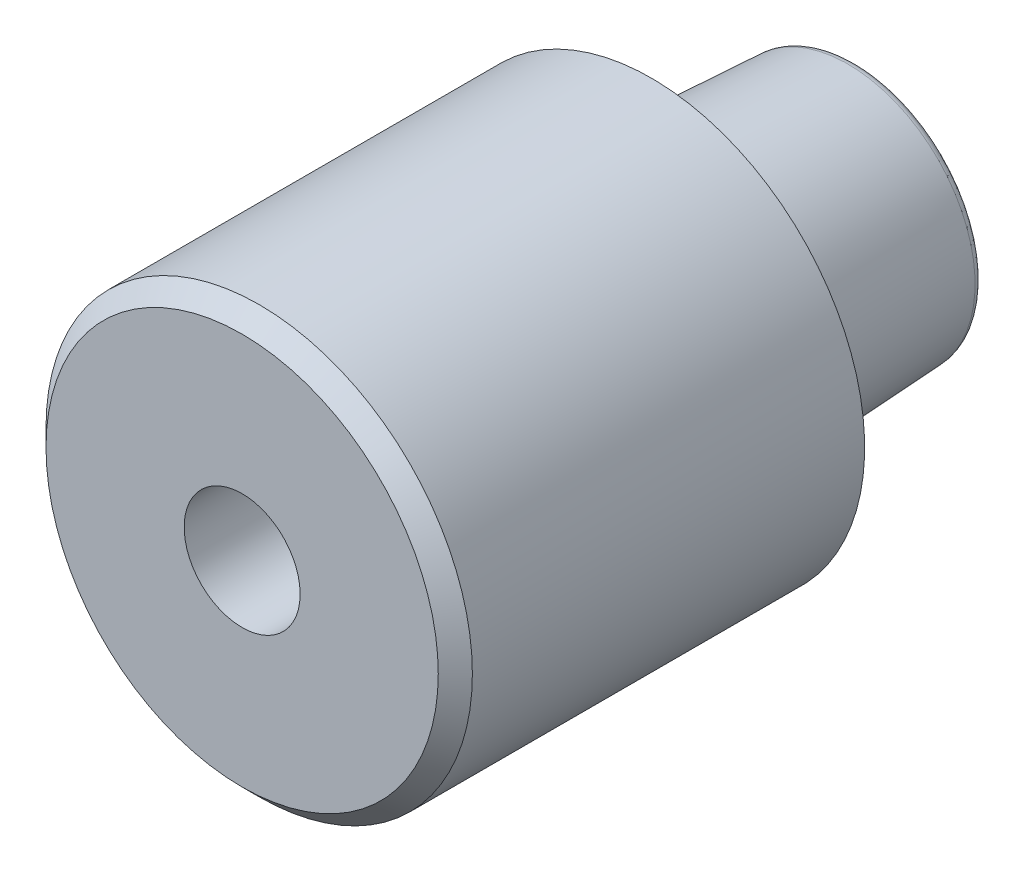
ISO-10303-21;
HEADER;
FILE_DESCRIPTION(('STEP AP214'),'2;1');
FILE_NAME('part.step','',(''),(''),'','','');
FILE_SCHEMA(('AUTOMOTIVE_DESIGN { 1 0 10303 214 1 1 1 1 }'));
ENDSEC;
DATA;
#1=APPLICATION_CONTEXT('core data for automotive mechanical design processes');
#2=APPLICATION_PROTOCOL_DEFINITION('international standard','automotive_design',2000,#1);
#3=PRODUCT_CONTEXT('',#1,'mechanical');
#4=PRODUCT('Part','Part','',(#3));
#5=PRODUCT_RELATED_PRODUCT_CATEGORY('part','',(#4));
#6=PRODUCT_DEFINITION_FORMATION('','',#4);
#7=PRODUCT_DEFINITION_CONTEXT('part definition',#1,'design');
#8=PRODUCT_DEFINITION('design','',#6,#7);
#9=PRODUCT_DEFINITION_SHAPE('','',#8);
#10=(LENGTH_UNIT() NAMED_UNIT(*) SI_UNIT(.MILLI.,.METRE.));
#11=(NAMED_UNIT(*) PLANE_ANGLE_UNIT() SI_UNIT($,.RADIAN.));
#12=(NAMED_UNIT(*) SI_UNIT($,.STERADIAN.) SOLID_ANGLE_UNIT());
#13=UNCERTAINTY_MEASURE_WITH_UNIT(LENGTH_MEASURE(1.E-05),#10,'distance_accuracy_value','');
#14=(GEOMETRIC_REPRESENTATION_CONTEXT(3) GLOBAL_UNCERTAINTY_ASSIGNED_CONTEXT((#13)) GLOBAL_UNIT_ASSIGNED_CONTEXT((#10,
#11,#12)) REPRESENTATION_CONTEXT('',''));
#15=CARTESIAN_POINT('',(0.,0.,0.));
#16=DIRECTION('',(0.,0.,1.));
#17=DIRECTION('',(1.,0.,0.));
#18=AXIS2_PLACEMENT_3D('',#15,#16,#17);
#19=CARTESIAN_POINT('',(1.31435631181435E-13,0.,18.8223304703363));
#20=DIRECTION('',(0.,0.,-1.));
#21=DIRECTION('',(1.,0.,0.));
#22=AXIS2_PLACEMENT_3D('',#19,#20,#21);
#23=CONICAL_SURFACE('',#22,17.6776695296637,0.785398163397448);
#24=CARTESIAN_POINT('',(1.74574066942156E-13,0.,25.));
#25=DIRECTION('',(0.,0.,-1.));
#26=DIRECTION('',(-1.,0.,0.));
#27=AXIS2_PLACEMENT_3D('',#24,#25,#26);
#28=CIRCLE('',#27,11.5);
#29=CARTESIAN_POINT('',(-11.4999999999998,0.,25.));
#30=VERTEX_POINT('',#29);
#31=CARTESIAN_POINT('',(11.5000000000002,0.,25.));
#32=VERTEX_POINT('',#31);
#33=EDGE_CURVE('E59',#30,#32,#28,.T.);
#34=ORIENTED_EDGE('',*,*,#33,.T.);
#35=CARTESIAN_POINT('',(11.4999968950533,0.,25.0000031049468));
#36=CARTESIAN_POINT('',(12.4999974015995,0.,24.0000025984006));
#37=B_SPLINE_CURVE_WITH_KNOTS('',1,(#35,#36),.UNSPECIFIED.,.F.,.F.,(2,2),(0.650538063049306,
0.707106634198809),.UNSPECIFIED.);
#38=CARTESIAN_POINT('',(12.5000000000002,0.,24.));
#39=VERTEX_POINT('',#38);
#40=EDGE_CURVE('E46',#32,#39,#37,.T.);
#41=ORIENTED_EDGE('',*,*,#40,.T.);
#42=CARTESIAN_POINT('',(1.6759110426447E-13,0.,24.));
#43=DIRECTION('',(0.,0.,1.));
#44=DIRECTION('',(-1.,0.,0.));
#45=AXIS2_PLACEMENT_3D('',#42,#43,#44);
#46=CIRCLE('',#45,12.5);
#47=CARTESIAN_POINT('',(-12.4999999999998,0.,24.));
#48=VERTEX_POINT('',#47);
#49=EDGE_CURVE('E97',#39,#48,#46,.T.);
#50=ORIENTED_EDGE('',*,*,#49,.T.);
#51=CARTESIAN_POINT('',(1.6759110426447E-13,0.,24.));
#52=DIRECTION('',(0.,0.,1.));
#53=DIRECTION('',(-1.,0.,0.));
#54=AXIS2_PLACEMENT_3D('',#51,#52,#53);
#55=CIRCLE('',#54,12.5);
#56=EDGE_CURVE('E11',#48,#39,#55,.T.);
#57=ORIENTED_EDGE('',*,*,#56,.T.);
#58=ORIENTED_EDGE('',*,*,#40,.F.);
#59=CARTESIAN_POINT('',(1.74574066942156E-13,0.,25.));
#60=DIRECTION('',(0.,0.,-1.));
#61=DIRECTION('',(-1.,0.,0.));
#62=AXIS2_PLACEMENT_3D('',#59,#60,#61);
#63=CIRCLE('',#62,11.5);
#64=EDGE_CURVE('E94',#32,#30,#63,.T.);
#65=ORIENTED_EDGE('',*,*,#64,.T.);
#66=EDGE_LOOP('',(#34,#41,#50,#57,#58,#65));
#67=FACE_BOUND('',#66,.T.);
#68=ADVANCED_FACE('F38',(#67),#23,.T.);
#69=CARTESIAN_POINT('',(0.,0.,13.));
#70=DIRECTION('',(0.,0.,-1.));
#71=DIRECTION('',(-1.,0.,0.));
#72=AXIS2_PLACEMENT_3D('',#69,#70,#71);
#73=CYLINDRICAL_SURFACE('',#72,12.5);
#74=ORIENTED_EDGE('',*,*,#49,.F.);
#75=ORIENTED_EDGE('',*,*,#56,.F.);
#76=CARTESIAN_POINT('',(-12.4999999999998,0.,24.0000008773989));
#77=CARTESIAN_POINT('',(-12.5,0.,0.999997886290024));
#78=B_SPLINE_CURVE_WITH_KNOTS('',1,(#76,#77),.UNSPECIFIED.,.F.,.F.,(2,2),(0.0833333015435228,
0.916666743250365),.UNSPECIFIED.);
#79=CARTESIAN_POINT('',(-12.5,0.,1.00000000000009));
#80=VERTEX_POINT('',#79);
#81=EDGE_CURVE('E132',#48,#80,#78,.T.);
#82=ORIENTED_EDGE('',*,*,#81,.T.);
#83=CARTESIAN_POINT('',(0.,0.,1.));
#84=DIRECTION('',(0.,0.,-1.));
#85=DIRECTION('',(-1.,0.,0.));
#86=AXIS2_PLACEMENT_3D('',#83,#84,#85);
#87=CIRCLE('',#86,12.5);
#88=EDGE_CURVE('E137',#80,#80,#87,.T.);
#89=ORIENTED_EDGE('',*,*,#88,.F.);
#90=ORIENTED_EDGE('',*,*,#81,.F.);
#91=EDGE_LOOP('',(#74,#75,#82,#89,#90));
#92=FACE_BOUND('',#91,.T.);
#93=ADVANCED_FACE('F182',(#92),#73,.T.);
#94=CARTESIAN_POINT('',(-14.9499999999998,-23.9023011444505,25.));
#95=DIRECTION('',(0.,0.,1.));
#96=DIRECTION('',(1.,0.,0.));
#97=AXIS2_PLACEMENT_3D('',#94,#95,#96);
#98=PLANE('',#97);
#99=CARTESIAN_POINT('',(0.,0.,24.9999999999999));
#100=DIRECTION('',(0.,0.,1.));
#101=DIRECTION('',(1.,0.,0.));
#102=AXIS2_PLACEMENT_3D('',#99,#100,#101);
#103=CIRCLE('',#102,3.39999999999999);
#104=CARTESIAN_POINT('',(3.39999999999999,0.,24.9999999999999));
#105=VERTEX_POINT('',#104);
#106=EDGE_CURVE('E95',#105,#105,#103,.T.);
#107=ORIENTED_EDGE('',*,*,#106,.F.);
#108=EDGE_LOOP('',(#107));
#109=FACE_BOUND('',#108,.T.);
#110=ORIENTED_EDGE('',*,*,#64,.F.);
#111=ORIENTED_EDGE('',*,*,#33,.F.);
#112=EDGE_LOOP('',(#110,#111));
#113=FACE_BOUND('',#112,.T.);
#114=ADVANCED_FACE('F185',(#109,#113),#98,.T.);
#115=CARTESIAN_POINT('',(0.,0.,-10.5));
#116=DIRECTION('',(0.,0.,-1.));
#117=DIRECTION('',(-1.,0.,0.));
#118=AXIS2_PLACEMENT_3D('',#115,#116,#117);
#119=TOROIDAL_SURFACE('',#118,6.94903214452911,0.5);
#120=CARTESIAN_POINT('',(0.,0.,-10.5261679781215));
#121=DIRECTION('',(0.,0.,-1.));
#122=DIRECTION('',(-1.,0.,0.));
#123=AXIS2_PLACEMENT_3D('',#120,#121,#122);
#124=CIRCLE('',#123,7.44834691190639);
#125=CARTESIAN_POINT('',(-7.44834691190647,0.,-10.5261679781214));
#126=VERTEX_POINT('',#125);
#127=EDGE_CURVE('E138',#126,#126,#124,.T.);
#128=ORIENTED_EDGE('',*,*,#127,.T.);
#129=CARTESIAN_POINT('',(-7.44834691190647,0.,-10.5261679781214));
#130=CARTESIAN_POINT('',(-7.42351442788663,0.,-10.9999999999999));
#131=CARTESIAN_POINT('',(-6.94903214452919,0.,-11.));
#132=(BOUNDED_CURVE() B_SPLINE_CURVE(2,(#129,#130,#131),.UNSPECIFIED.,.F.,
.F.) B_SPLINE_CURVE_WITH_KNOTS((3,3),(0.,0.5),
.UNSPECIFIED.) CURVE() GEOMETRIC_REPRESENTATION_ITEM() RATIONAL_B_SPLINE_CURVE((1.,
0.725374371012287,1.)) REPRESENTATION_ITEM(''));
#133=CARTESIAN_POINT('',(-6.94903214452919,0.,-11.));
#134=VERTEX_POINT('',#133);
#135=EDGE_CURVE('E121',#126,#134,#132,.T.);
#136=ORIENTED_EDGE('',*,*,#135,.T.);
#137=CARTESIAN_POINT('',(0.,0.,-11.));
#138=DIRECTION('',(0.,0.,1.));
#139=DIRECTION('',(-1.,0.,0.));
#140=AXIS2_PLACEMENT_3D('',#137,#138,#139);
#141=CIRCLE('',#140,6.94903214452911);
#142=EDGE_CURVE('E127',#134,#134,#141,.T.);
#143=ORIENTED_EDGE('',*,*,#142,.T.);
#144=ORIENTED_EDGE('',*,*,#135,.F.);
#145=EDGE_LOOP('',(#128,#136,#143,#144));
#146=FACE_BOUND('',#145,.T.);
#147=ADVANCED_FACE('F187',(#146),#119,.T.);
#148=CARTESIAN_POINT('',(0.,0.,0.));
#149=DIRECTION('',(0.,0.,1.));
#150=DIRECTION('',(-1.,0.,0.));
#151=AXIS2_PLACEMENT_3D('',#148,#149,#150);
#152=CONICAL_SURFACE('',#151,8.,0.0523598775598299);
#153=ORIENTED_EDGE('',*,*,#127,.F.);
#154=CARTESIAN_POINT('',(-7.44834691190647,0.,-10.5261679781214));
#155=CARTESIAN_POINT('',(-8.,0.,0.));
#156=B_SPLINE_CURVE_WITH_KNOTS('',1,(#154,#155),.UNSPECIFIED.,.F.,.F.,(2,2),(0.,1.),.UNSPECIFIED.);
#157=CARTESIAN_POINT('',(-8.,0.,0.));
#158=VERTEX_POINT('',#157);
#159=EDGE_CURVE('E110',#126,#158,#156,.T.);
#160=ORIENTED_EDGE('',*,*,#159,.T.);
#161=CARTESIAN_POINT('',(0.,0.,0.));
#162=DIRECTION('',(0.,0.,-1.));
#163=DIRECTION('',(-1.,0.,0.));
#164=AXIS2_PLACEMENT_3D('',#161,#162,#163);
#165=CIRCLE('',#164,8.);
#166=EDGE_CURVE('E116',#158,#158,#165,.T.);
#167=ORIENTED_EDGE('',*,*,#166,.T.);
#168=ORIENTED_EDGE('',*,*,#159,.F.);
#169=EDGE_LOOP('',(#153,#160,#167,#168));
#170=FACE_BOUND('',#169,.T.);
#171=ADVANCED_FACE('F194',(#170),#152,.T.);
#172=CARTESIAN_POINT('',(15.9827739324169,-14.4432920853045,-11.));
#173=DIRECTION('',(0.,0.,-1.));
#174=DIRECTION('',(-1.,0.,0.));
#175=AXIS2_PLACEMENT_3D('',#172,#173,#174);
#176=PLANE('',#175);
#177=ORIENTED_EDGE('',*,*,#142,.F.);
#178=EDGE_LOOP('',(#177));
#179=FACE_BOUND('',#178,.T.);
#180=ADVANCED_FACE('F222',(#179),#176,.T.);
#181=CARTESIAN_POINT('',(0.,0.,0.5));
#182=DIRECTION('',(0.,0.,-1.));
#183=DIRECTION('',(-1.,0.,0.));
#184=AXIS2_PLACEMENT_3D('',#181,#182,#183);
#185=CYLINDRICAL_SURFACE('',#184,8.);
#186=CARTESIAN_POINT('',(0.,0.,1.));
#187=DIRECTION('',(0.,0.,1.));
#188=DIRECTION('',(-1.,0.,0.));
#189=AXIS2_PLACEMENT_3D('',#186,#187,#188);
#190=CIRCLE('',#189,8.);
#191=CARTESIAN_POINT('',(-8.,0.,1.00000000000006));
#192=VERTEX_POINT('',#191);
#193=EDGE_CURVE('E105',#192,#192,#190,.T.);
#194=ORIENTED_EDGE('',*,*,#193,.F.);
#195=CARTESIAN_POINT('',(-8.,0.,1.00000305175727));
#196=CARTESIAN_POINT('',(-8.,0.,5.31746931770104E-07));
#197=B_SPLINE_CURVE_WITH_KNOTS('',1,(#195,#196),.UNSPECIFIED.,.F.,.F.,(2,2),(0.0833307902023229,
0.91666622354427),.UNSPECIFIED.);
#198=EDGE_CURVE('E102',#192,#158,#197,.T.);
#199=ORIENTED_EDGE('',*,*,#198,.T.);
#200=ORIENTED_EDGE('',*,*,#166,.F.);
#201=ORIENTED_EDGE('',*,*,#198,.F.);
#202=EDGE_LOOP('',(#194,#199,#200,#201));
#203=FACE_BOUND('',#202,.T.);
#204=ADVANCED_FACE('F231',(#203),#185,.T.);
#205=CARTESIAN_POINT('',(28.75,-25.9807621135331,0.999999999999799));
#206=DIRECTION('',(0.,0.,-1.));
#207=DIRECTION('',(-1.,0.,0.));
#208=AXIS2_PLACEMENT_3D('',#205,#206,#207);
#209=PLANE('',#208);
#210=ORIENTED_EDGE('',*,*,#88,.T.);
#211=EDGE_LOOP('',(#210));
#212=FACE_BOUND('',#211,.T.);
#213=ORIENTED_EDGE('',*,*,#193,.T.);
#214=EDGE_LOOP('',(#213));
#215=FACE_BOUND('',#214,.T.);
#216=ADVANCED_FACE('F88',(#212,#215),#209,.T.);
#217=CARTESIAN_POINT('',(0.,0.,6.9999999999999));
#218=DIRECTION('',(0.,0.,1.));
#219=DIRECTION('',(1.,0.,0.));
#220=AXIS2_PLACEMENT_3D('',#217,#218,#219);
#221=CONICAL_SURFACE('',#220,3.4,1.02974425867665);
#222=CARTESIAN_POINT('',(0.,0.,4.95707389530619));
#223=VERTEX_POINT('',#222);
#224=VERTEX_LOOP('',#223);
#225=FACE_BOUND('',#224,.T.);
#226=CARTESIAN_POINT('',(0.,0.,6.9999999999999));
#227=DIRECTION('',(0.,0.,1.));
#228=DIRECTION('',(1.,0.,0.));
#229=AXIS2_PLACEMENT_3D('',#226,#227,#228);
#230=CIRCLE('',#229,3.4);
#231=CARTESIAN_POINT('',(3.4,0.,6.9999999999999));
#232=VERTEX_POINT('',#231);
#233=EDGE_CURVE('E92',#232,#232,#230,.T.);
#234=ORIENTED_EDGE('',*,*,#233,.T.);
#235=EDGE_LOOP('',(#234));
#236=FACE_BOUND('',#235,.T.);
#237=ADVANCED_FACE('F84',(#225,#236),#221,.F.);
#238=CARTESIAN_POINT('',(0.,0.,24.9999999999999));
#239=DIRECTION('',(0.,0.,1.));
#240=DIRECTION('',(1.,0.,0.));
#241=AXIS2_PLACEMENT_3D('',#238,#239,#240);
#242=CYLINDRICAL_SURFACE('',#241,3.39999999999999);
#243=ORIENTED_EDGE('',*,*,#233,.F.);
#244=EDGE_LOOP('',(#243));
#245=FACE_BOUND('',#244,.T.);
#246=ORIENTED_EDGE('',*,*,#106,.T.);
#247=EDGE_LOOP('',(#246));
#248=FACE_BOUND('',#247,.T.);
#249=ADVANCED_FACE('F87',(#245,#248),#242,.F.);
#250=CLOSED_SHELL('',(#68,#93,#114,#147,#171,#180,#204,#216,#237,#249));
#251=MANIFOLD_SOLID_BREP('B2',#250);
#252=ADVANCED_BREP_SHAPE_REPRESENTATION('',(#18,#251),#14);
#253=SHAPE_DEFINITION_REPRESENTATION(#9,#252);
ENDSEC;
END-ISO-10303-21;
